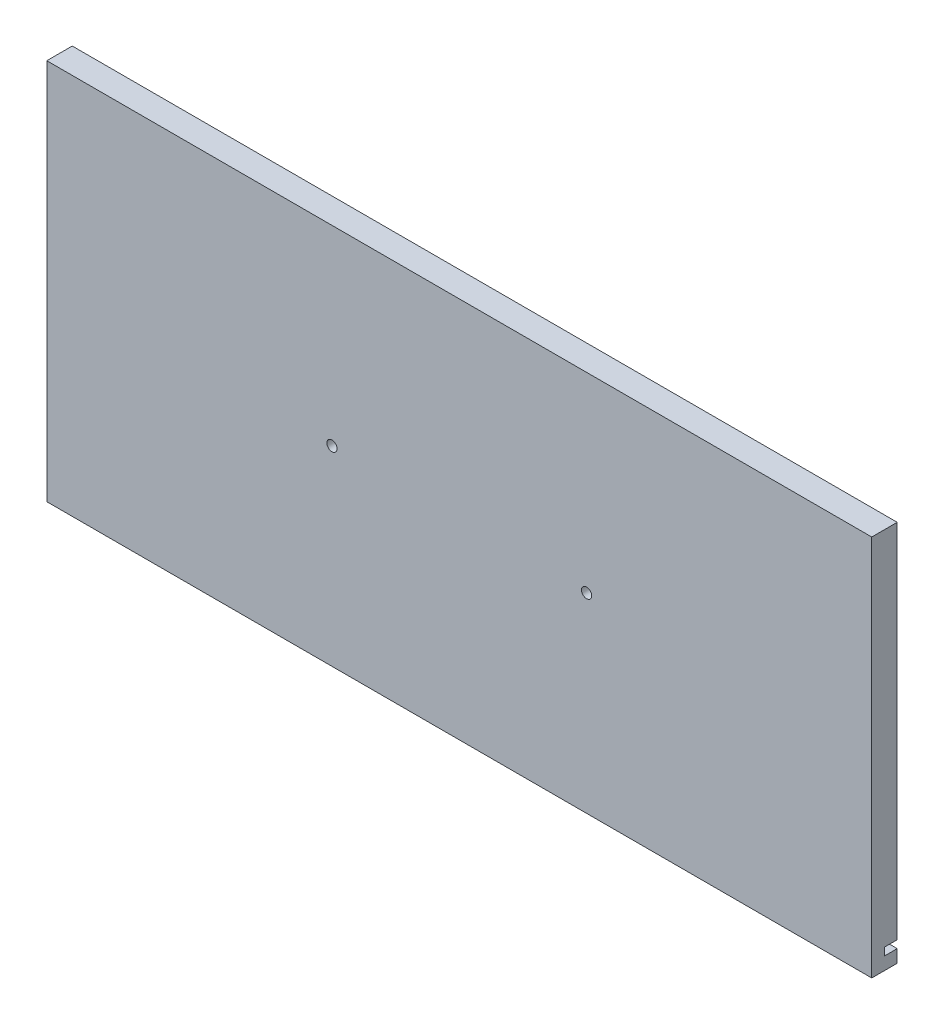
from build123d import *

# Parameters (mm, degrees)
SKETCH1_W           = 324
SKETCH1_H           = 150
BOSS_EXTRUDE1_DEPTH = 10
SKETCH2_R           = 2.5
CUT_EXTRUDE1_DEPTH  = 5
SKETCH3_W           = 324
SKETCH3_H           = 3
CUT_EXTRUDE2_DEPTH  = 5
SKETCH4_R           = 2
CUT_EXTRUDE3_DEPTH  = 6


with BuildPart() as part:
    # Sketch1 → Boss-Extrude1 (new body)
    with BuildSketch(Plane.XY):
        Rectangle(SKETCH1_W, SKETCH1_H)
    extrude(amount=BOSS_EXTRUDE1_DEPTH)

    # Sketch2 → Cut-Extrude1 (cut)
    with BuildSketch(Plane(origin=(0, 0, 0), x_dir=(-1, 0, 0), z_dir=(0, 0, -1))):
        with Locations((-130.5, 17.5)):
            Circle(SKETCH2_R)
        with Locations(Location((140.5, 17.5, 0), (0, 0, 180))):
            Circle(SKETCH2_R)
        with Locations((140.5, -57.5)):
            Circle(SKETCH2_R)
        with Locations(Location((-130.5, -57.5, 0), (0, 0, 180))):
            Circle(SKETCH2_R)
    extrude(amount=-CUT_EXTRUDE1_DEPTH, mode=Mode.SUBTRACT)

    # Sketch3 → Cut-Extrude2 (cut)
    with BuildSketch(Plane(origin=(0, 0, 0), x_dir=(-1, 0, 0), z_dir=(0, 0, -1))):
        with Locations((0, -68.5)):
            Rectangle(SKETCH3_W, SKETCH3_H)
    extrude(amount=-CUT_EXTRUDE2_DEPTH, mode=Mode.SUBTRACT)

    # Sketch4 → Cut-Extrude3 (cut)
    with BuildSketch(Plane.XY.offset(10)):
        with Locations((-50, 0)):
            Circle(SKETCH4_R)
        with Locations(Location((50, 0, 0), (0, 0, 180))):
            Circle(SKETCH4_R)
    extrude(amount=-CUT_EXTRUDE3_DEPTH, mode=Mode.SUBTRACT)


solid = part.part
